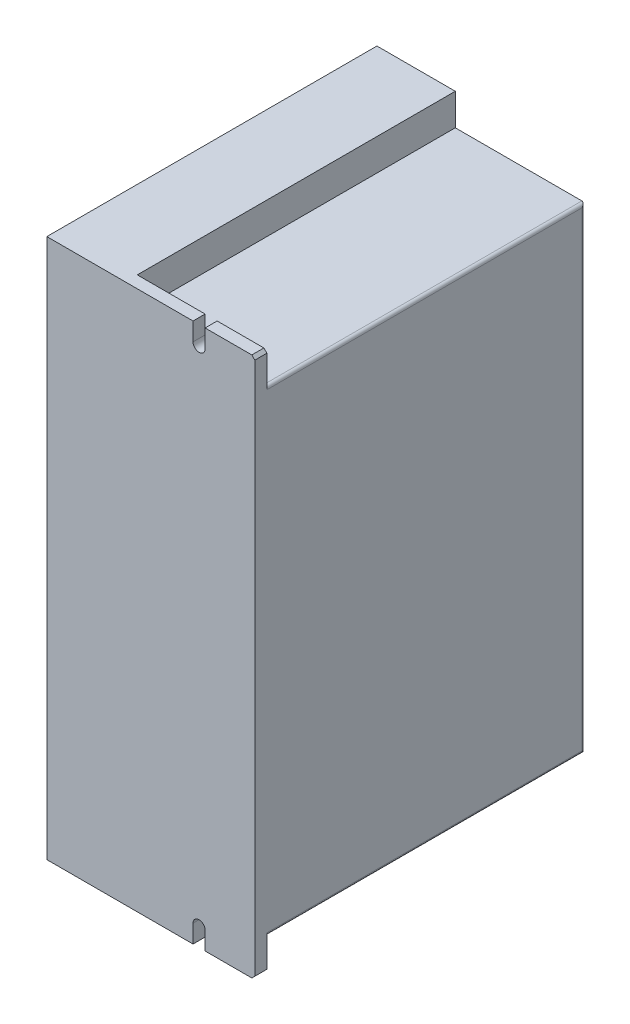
from build123d import *

# Parameters (mm, degrees)
SKETCH_1_W          = 109.5
SKETCH_1_H          = 179
EXTRUDE_1_DEPTH     = 69
SKETCH_2_W          = 105.5
SKETCH_2_H          = 10.5
CUT_EXTRUDE_1_DEPTH = 43
CUT_EXTRUDE_2_DEPTH = 4
FILLET_1_R          = 1
CHAMFER_1_SIZE      = 1


with BuildPart() as part:
    # Sketch 1 → Extrude 1 (new body)
    with BuildSketch(Plane(origin=(0, 0, 0), x_dir=(0, 0, -1), z_dir=(1, 0, 0))):
        Rectangle(SKETCH_1_W, SKETCH_1_H)
    extrude(amount=EXTRUDE_1_DEPTH)

    # Sketch 2 → Cut-Extrude 1 (cut)
    with BuildSketch(Plane(origin=(69, 0, 0), x_dir=(0, 0, -1), z_dir=(1, 0, 0))):
        with Locations((2, 84.25)):
            Rectangle(SKETCH_2_W, SKETCH_2_H)
        with Locations((2, -84.25)):
            Rectangle(SKETCH_2_W, SKETCH_2_H)
    extrude(amount=-CUT_EXTRUDE_1_DEPTH, mode=Mode.SUBTRACT)

    # Sketch 3 → Cut-Extrude 2 (cut)
    with BuildSketch(Plane.XY.offset(54.75)):
        with BuildLine():
            Line((48.5, 83.5), (48.5, 89.5))
            Line((48.5, 89.5), (52.5, 89.5))
            Line((52.5, 89.5), (52.5, 83.5))
            ThreePointArc((52.5, 83.5), (50.5, 81.5), (48.5, 83.5))
        make_face()
        with BuildLine():
            Line((48.5, -83.5), (48.5, -89.5))
            Line((48.5, -89.5), (52.5, -89.5))
            Line((52.5, -89.5), (52.5, -83.5))
            ThreePointArc((52.5, -83.5), (50.5, -81.5), (48.5, -83.5))
        make_face()
    extrude(amount=-CUT_EXTRUDE_2_DEPTH, mode=Mode.SUBTRACT)

    # Fillet 1
    fillet_1_edges = [part.edges().sort_by_distance(p)[0] for p in [
        (69, 79, -2),
        (69, 0, -54.75),
        (69, -79, -2),
    ]]
    fillet(fillet_1_edges, radius=FILLET_1_R)

    # Chamfer 1
    chamfer_1_edges = [part.edges().sort_by_distance(p)[0] for p in [
        (69, -89.5, 52.75),
        (69, 89.5, 52.75),
    ]]
    chamfer(chamfer_1_edges, length=CHAMFER_1_SIZE)


solid = part.part
